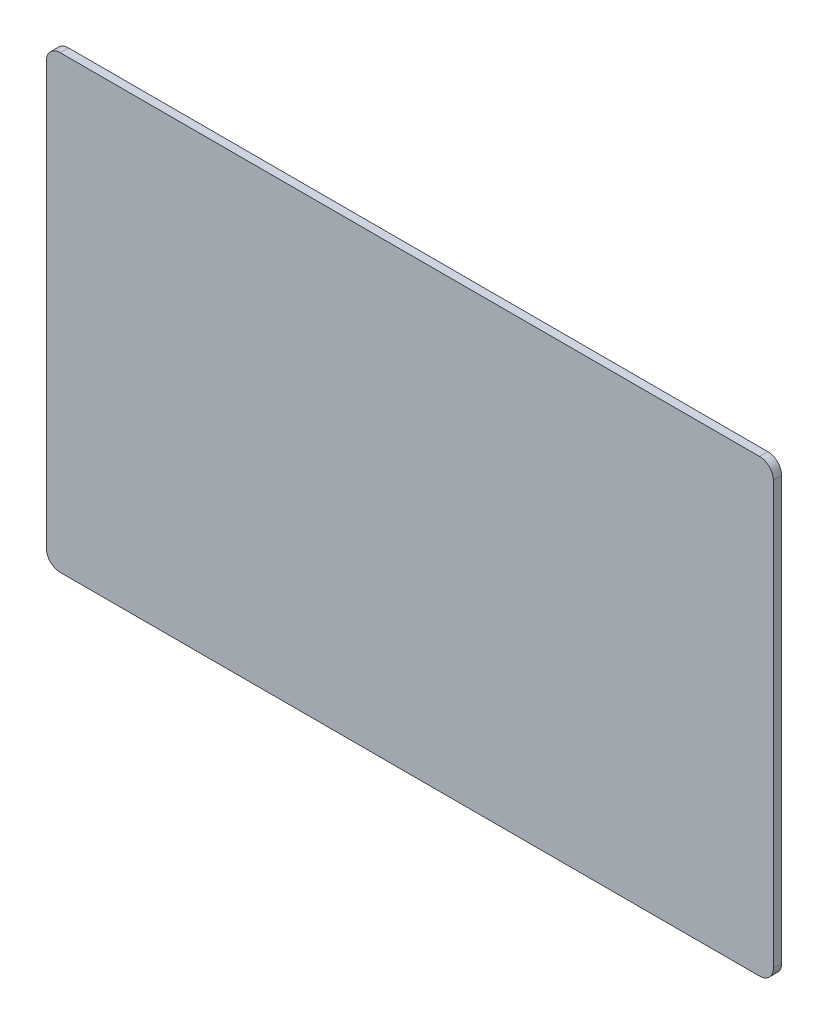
from build123d import *

# Parameters (mm, degrees)
CROQUIS1_W              = 105
CROQUIS1_H              = 65
SALIENTE_EXTRUIR1_DEPTH = 1.2
REDONDEO1_R             = 2
CROQUIS3_W              = 11
CROQUIS3_H              = 5.2
SALIENTE_EXTRUIR2_DEPTH = 1.6


with BuildPart() as part:
    # Croquis1 → Saliente-Extruir1 (new body)
    with BuildSketch(Plane.XY):
        Rectangle(CROQUIS1_W, CROQUIS1_H)
    extrude(amount=SALIENTE_EXTRUIR1_DEPTH)

    # Redondeo1
    redondeo1_edges = [part.edges().sort_by_distance(p)[0] for p in [
        (52.5, -32.5, 0.6),
        (-52.5, -32.5, 0.6),
        (-52.5, 32.5, 0.6),
        (52.5, 32.5, 0.6),
    ]]
    fillet(redondeo1_edges, radius=REDONDEO1_R)

    # Croquis3 → Saliente-Extruir2 (add)
    with BuildSketch(Plane(origin=(0, 0, 0), x_dir=(-1, 0, 0), z_dir=(0, 0, -1))):
        with Locations((0, -25.2)):
            Rectangle(CROQUIS3_W, CROQUIS3_H)
    extrude(amount=SALIENTE_EXTRUIR2_DEPTH)


solid = part.part
